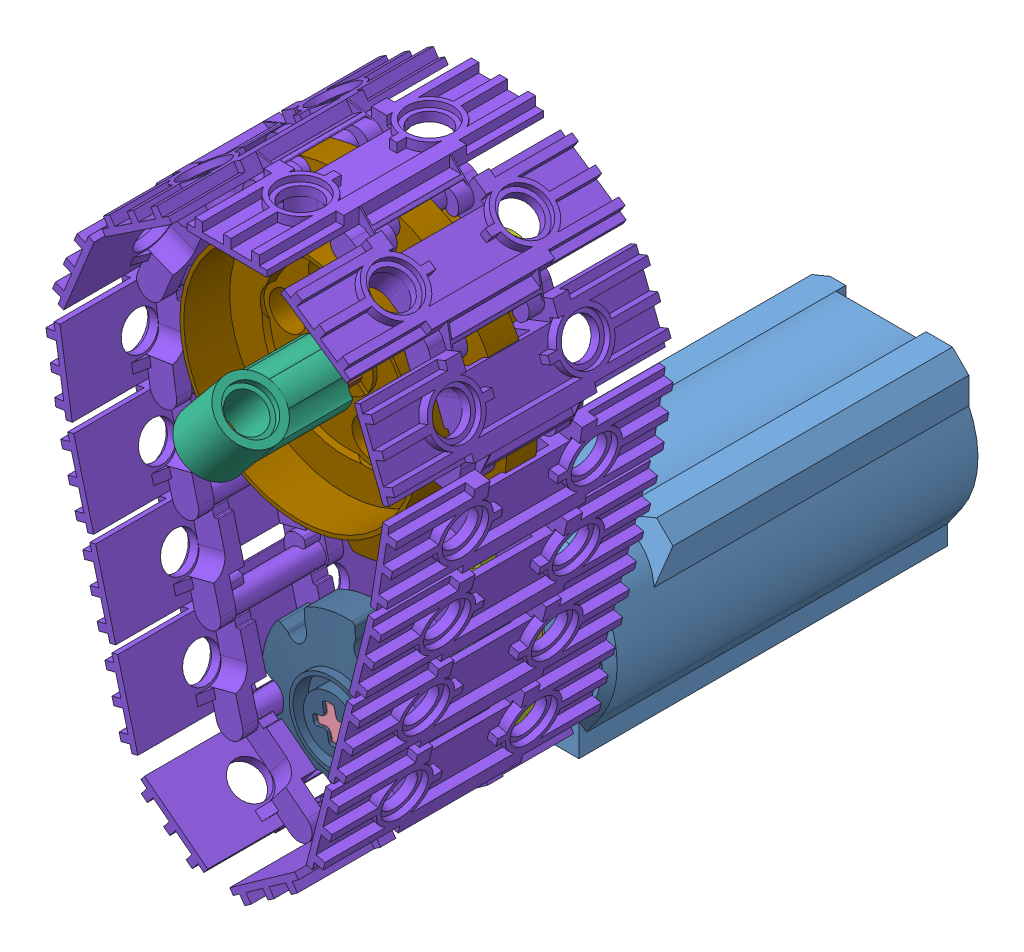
SolidWorks assembly 145.SLDASM, configuration 기본 (file format 9000). Lengths in mm.
Overall size (59.05 83.86 89.1).
27 component instances, 11 part files, 30 mates.
Components (placement in the parent):
- 9V Motor M-1: 9V Motor M.SLDPRT [기본] at (-7.9913 -1.4886 48.1336) size (24 24 48.27)
- Motor 9V  PF Medium part-1: Motor 9V  PF Medium part.SLDPRT [기본] at (-5.9308 -1.6007 64.1336) x (0.977824 0.209428 0) z (0 0 1) size (7 7 8)
- 2780 Pin with Friction Ridges Lengthwise WITH Center Slots-1: 2780 Pin with Friction Ridges Lengthwise WITH Center Slots.SLDPRT [기본] at (-8.0613 6.5114 72.4336) x (1 0 0) z (0 1 0) size (6 16 5.88)
- 3705 Axle 4-1: 3705 Axle 4.SLDPRT [기본] at (-7.9913 -1.4886 96.1336) x (0.977824 0.209428 0) z (-0.209428 0.977824 0) size (4.8 32.01 4.8)
- 3713 Bush-1: 3713 Bush.SLDPRT [기본] at (-7.9913 -1.4886 84.4336) x (0.977824 0.209428 0) z (-0.209428 0.977824 0) size (7.2 8.01 7.2)
- 32013 Axle pin connector angled #1-1: 32013 Axle pin connector angled #1.SLDPRT [기본] at (-8.2013 38.511 97.2336) x (0 0 -1) z (0.635724 0.771916 0) size (16 8 8)
- 32524 Beam 7-1: 32524 Beam 7.SLDPRT [기본] at (-8.2013 38.511 80.4336) x (0.004375 -0.99999 0) z (0.99999 0.004375 0) size (55.2 8 7.2)
- 57518 Link Tread Wide-1: 57518 Link Tread Wide.SLDPRT [기본] at (7.0422 50.5923 92.4336) x (-0.364197 0.931322 0) z (0 0 -1) size (16.15 5.5 36)
- 57519 Tread Sprocket Wheel Large-1: 57519 Tread Sprocket Wheel Large.SLDPRT [기본] at (-8.2013 38.511 92.4121) x (0.635724 0.771916 0) z (0.771916 -0.635724 0) size (41.77 16 42.1)
- 57520-1: 57520.SLDPRT [기본] at (-7.9913 -1.4886 92.4336) x (-0.977824 -0.209428 0) z (-0.209428 0.977824 0) size (21.36 8 22)
- 87083 Axle 4 w stop-1: 87083 Axle 4 w stop.SLDPRT [기본] at (-8.2013 38.511 73.2336) x (0.635724 0.771916 0) z (0.771916 -0.635724 0) size (6 32.8 6)
- 3713 Bush-2: 3713 Bush.SLDPRT [기본] at (-8.2013 38.511 84.4336) x (0.635724 0.771916 0) z (0.771916 -0.635724 0) size (7.2 8.01 7.2)
- 2780 Pin with Friction Ridges Lengthwise WITH Center Slots-2: 2780 Pin with Friction Ridges Lengthwise WITH Center Slots.SLDPRT [기본] at (-7.9913 -9.4886 72.4336) x (1 0 0) z (0 1 0) size (6 16 5.88)
- 57518 Link Tread Wide-2: 57518 Link Tread Wide.SLDPRT [기본] at (11.194 39.9752 92.4336) x (0.157176 0.987571 0) z (0 0 -1) size (16.15 5.5 36)
- 57518 Link Tread Wide-3: 57518 Link Tread Wide.SLDPRT [기본] at (9.4022 28.7169 92.4336) x (0.242015 0.970272 0) z (0 0 -1) size (16.15 5.5 36)
- 57518 Link Tread Wide-4: 57518 Link Tread Wide.SLDPRT [기본] at (6.6432 17.6558 92.4336) x (0.242015 0.970272 0) z (0 0 -1) size (16.15 5.5 36)
- 57518 Link Tread Wide-5: 57518 Link Tread Wide.SLDPRT [기본] at (3.8842 6.5947 92.4336) x (0.244092 0.969752 0) z (0 0 -1) size (16.15 5.5 36)
- 57518 Link Tread Wide-6: 57518 Link Tread Wide.SLDPRT [기본] at (1.1016 -4.4605 92.4336) x (0.815855 0.578257 0) z (0 0 -1) size (16.15 5.5 36)
- 57518 Link Tread Wide-7: 57518 Link Tread Wide.SLDPRT [기본] at (-8.1991 -11.0526 92.4336) x (0.789967 -0.61315 0) z (0 0 -1) size (16.15 5.5 36)
- 57518 Link Tread Wide-8: 57518 Link Tread Wide.SLDPRT [기본] at (-17.2048 -4.0627 92.4336) x (0.252314 -0.967645 0) z (0 0 -1) size (16.15 5.5 36)
- 57518 Link Tread Wide-9: 57518 Link Tread Wide.SLDPRT [기본] at (-20.0811 6.9685 92.4336) x (0.252189 -0.967678 0) z (0 0 -1) size (16.15 5.5 36)
- 57518 Link Tread Wide-10: 57518 Link Tread Wide.SLDPRT [기본] at (-22.9561 18 92.4336) x (0.252189 -0.967678 0) z (0 0 -1) size (16.15 5.5 36)
- 57518 Link Tread Wide-11: 57518 Link Tread Wide.SLDPRT [기본] at (-25.8311 29.0315 92.4336) x (0.1525 -0.988303 0) z (0 0 -1) size (16.15 5.5 36)
- 57518 Link Tread Wide-12: 57518 Link Tread Wide.SLDPRT [기본] at (-27.5696 40.2982 92.4336) x (-0.379663 -0.925125 0) z (0 0 -1) size (16.15 5.5 36)
- 57518 Link Tread Wide-13: 57518 Link Tread Wide.SLDPRT [기본] at (-23.2414 50.8446 92.4336) x (-0.832866 -0.553475 0) z (0 0 -1) size (16.15 5.5 36)
- 57518 Link Tread Wide-14: 57518 Link Tread Wide.SLDPRT [기본] at (-13.7467 57.1542 92.4336) x (-0.999966 0.008302 0) z (0 0 -1) size (16.15 5.5 36)
- 57518 Link Tread Wide-15: 57518 Link Tread Wide.SLDPRT [기본] at (-2.3471 57.0596 92.4336) x (-0.823561 0.567228 0) z (0 0 -1) size (16.15 5.5 36)
Mates (geometry in assembly coordinates):
- 동심1: concentric: cylinder of 9V Motor M-1 through (-7.9913 -1.4886 72.1336) axis (0 0 1) radius 3.505; cylinder of Motor 9V  PF Medium part-1 through (-7.9913 -1.4886 72.1336) axis (0 0 -1) radius 3.5
- 일치1: coincident: plane of 9V Motor M-1 through (-7.9913 -1.4886 72.1336) normal (0 0 1); plane of Motor 9V  PF Medium part-1 through (-7.9913 -1.4886 72.1336) normal (0 0 1)
- 동심2: concentric: cylinder of 9V Motor M-1 through (-8.0613 6.5114 72.1336) axis (0 0 1) radius 2.4; cylinder of 2780 Pin with Friction Ridges Lengthwise WITH Center Slots-1 through (-8.0613 6.5114 80.4336) axis (0 0 -1) radius 2.4
- 일치2: coincident: plane of 9V Motor M-1 through (-5.6613 6.5114 71.6336) normal (0 0 1); plane of 2780 Pin with Friction Ridges Lengthwise WITH Center Slots-1 through (-8.0613 6.5114 71.6336) normal (0 0 -1)
- 동심3: concentric: cylinder of 9V Motor M-1 through (-7.9913 -9.4886 72.1336) axis (0 0 1) radius 2.4; cylinder of 2780 Pin with Friction Ridges Lengthwise WITH Center Slots-2 through (-7.9913 -9.4886 80.4336) axis (0 0 -1) radius 2.4
- 일치3: coincident: plane of 9V Motor M-1 through (-5.5913 -9.4886 71.6336) normal (0 0 1); plane of 2780 Pin with Friction Ridges Lengthwise WITH Center Slots-2 through (-7.9913 -9.4886 71.6336) normal (0 0 -1)
- 동심4: concentric: cylinder of Motor 9V  PF Medium part-1 through (-7.9913 -1.4886 72.1336) axis (0 0 -1) radius 2.4; cylinder of 3705 Axle 4-1 through (-7.9913 -1.4886 64.1336) axis (0 0 1) radius 2.4
- 일치4: coincident: plane of Motor 9V  PF Medium part-1 through (-6.1426 -3.019 72.1336) normal (-0.875709 -0.482839 0); plane of 3705 Axle 4-1 through (-6.1426 -3.019 64.1336) normal (0.875709 0.482839 0)
- 일치5: coincident: circle of Motor 9V  PF Medium part-1; plane of 3705 Axle 4-1 through (-7.9913 -1.4886 64.1336) normal (0 0 -1)
- 동심5: concentric: cylinder of 32524 Beam 7-1 through (-7.9913 -9.4884 72.4336) axis (0 0 1) radius 2.4; cylinder of 2780 Pin with Friction Ridges Lengthwise WITH Center Slots-2 through (-7.9913 -9.4886 80.4336) axis (0 0 -1) radius 2.4
- 동심6: concentric: cylinder of 2780 Pin with Friction Ridges Lengthwise WITH Center Slots-1 through (-8.0613 6.5114 80.4336) axis (0 0 -1) radius 2.4; cylinder of 32524 Beam 7-1 through (-8.0613 6.5114 72.4336) axis (0 0 1) radius 2.4
- 일치6: coincident: plane of 32524 Beam 7-1 through (-7.9913 -9.4884 73.2336) normal (0 0 -1); plane of 2780 Pin with Friction Ridges Lengthwise WITH Center Slots-2 through (-7.9913 -9.4886 73.2336) normal (0 0 1)
- 동심7: concentric: cylinder of 3705 Axle 4-1 through (-7.9913 -1.4886 64.1336) axis (0 0 1) radius 2.4; cylinder of 3713 Bush-1 through (-7.9913 -1.4886 88.4336) axis (0 0 -1) radius 2.4
- 일치7: coincident: plane of 3705 Axle 4-1 through (-9.8401 0.0418 64.1336) normal (-0.875709 -0.482839 0); plane of 3713 Bush-1 through (-9.38 -0.7926 88.4336) normal (0.875709 0.482839 0)
- 일치8: coincident: plane of 3713 Bush-1 through (-7.9913 -1.4886 80.4336) normal (0 0 -1); plane of 32524 Beam 7-1 through (-8.2013 38.5111 80.4336) normal (0 0 1)
- 동심8: concentric: cylinder of 3705 Axle 4-1 through (-7.9913 -1.4886 64.1336) axis (0 0 1) radius 2.4; cylinder of 57520-1 through (-7.9913 -1.4886 88.4336) axis (0 0 1) radius 2.4
- 평행1: parallel: plane of 3705 Axle 4-1 through (-9.8401 0.0418 64.1336) normal (-0.875709 -0.482839 0); plane of 57520-1 through (-8.1985 -2.4199 88.4336) normal (0.875709 0.482839 0)
- 일치11: coincident: plane of 3713 Bush-1 through (-7.9913 -1.4886 88.4336) normal (0 0 1); plane of 57520-1 through (-7.9913 -1.4886 88.4336) normal (0 0 -1)
- 동심9: concentric: cylinder of 32524 Beam 7-1 through (-8.2013 38.5111 72.4336) axis (0 0 1) radius 2.4; cylinder of 87083 Axle 4 w stop-1 through (-8.2013 38.5111 105.2336) axis (0 0 -1) radius 2.4
- 일치13: coincident: plane of 32524 Beam 7-1 through (-8.2013 38.5111 73.2336) normal (0 0 -1); plane of 87083 Axle 4 w stop-1 through (-8.2013 38.5111 73.2336) normal (0 0 1)
- 동심10: concentric: cylinder of 57519 Tread Sprocket Wheel Large-1 through (-8.2013 38.5111 90.3958) axis (0 0 1) radius 2.4; cylinder of 87083 Axle 4 w stop-1 through (-8.2013 38.5111 105.2336) axis (0 0 -1) radius 2.4
- 평행2: parallel: plane of 57519 Tread Sprocket Wheel Large-1 through (-7.2981 38.8184 90.3958) normal (-0.867777 0.496954 0); plane of 87083 Axle 4 w stop-1 through (-6.3281 40.0114 105.2336) normal (0.867777 -0.496954 0)
- 동심11: concentric: cylinder of 87083 Axle 4 w stop-1 through (-8.2013 38.5111 105.2336) axis (0 0 -1) radius 2.4; cylinder of 3713 Bush-2 through (-8.2013 38.5111 80.4336) axis (0 0 1) radius 2.4
- 일치16: coincident: plane of 87083 Axle 4 w stop-1 through (-7.875 37.3101 105.2336) normal (0.867777 -0.496954 0); plane of 3713 Bush-2 through (-8.5473 36.1362 80.4336) normal (-0.867777 0.496954 0)
- 일치17: coincident: plane of 32524 Beam 7-1 through (-8.2013 38.5111 80.4336) normal (0 0 1); plane of 3713 Bush-2 through (-8.2013 38.5111 80.4336) normal (0 0 -1)
- 동심12: concentric: cylinder of 32013 Axle pin connector angled #1-1 through (-8.2013 38.5111 113.2346) axis (0 0 -1) radius 2.4; cylinder of 87083 Axle 4 w stop-1 through (-8.2013 38.5111 105.2336) axis (0 0 -1) radius 2.4
- 일치19: coincident: plane of 32013 Axle pin connector angled #1-1 through (-7.0004 38.8374 113.2346) normal (-0.867777 0.496954 0); plane of 87083 Axle 4 w stop-1 through (-6.3281 40.0114 105.2336) normal (0.867777 -0.496954 0)
- 탄젠트1: tangent: cylinder of 32013 Axle pin connector angled #1-1 through (-10.1891 35.04 109.2336) axis (0.496954 0.867777 0) radius 4; plane of 87083 Axle 4 w stop-1 through (-8.2013 38.5111 105.2336) normal (0 0 1)
- 일치21: coincident: plane of 57519 Tread Sprocket Wheel Large-1 through (-8.2013 38.5111 90.4121) normal (0 0 -1); plane of 57520-1 through (-2.9215 -10.6835 90.4121) normal (0 0 -1)
- 기어 메이트1: gear = 10.9 mm: cylinder of 57519 Tread Sprocket Wheel Large-1 through (-8.2013 38.5111 88.1352) axis (0 0 -1) radius 15.5; cylinder of 57520-1 through (-7.9913 -1.4886 86.1631) axis (0 0 -1) radius 5.45
